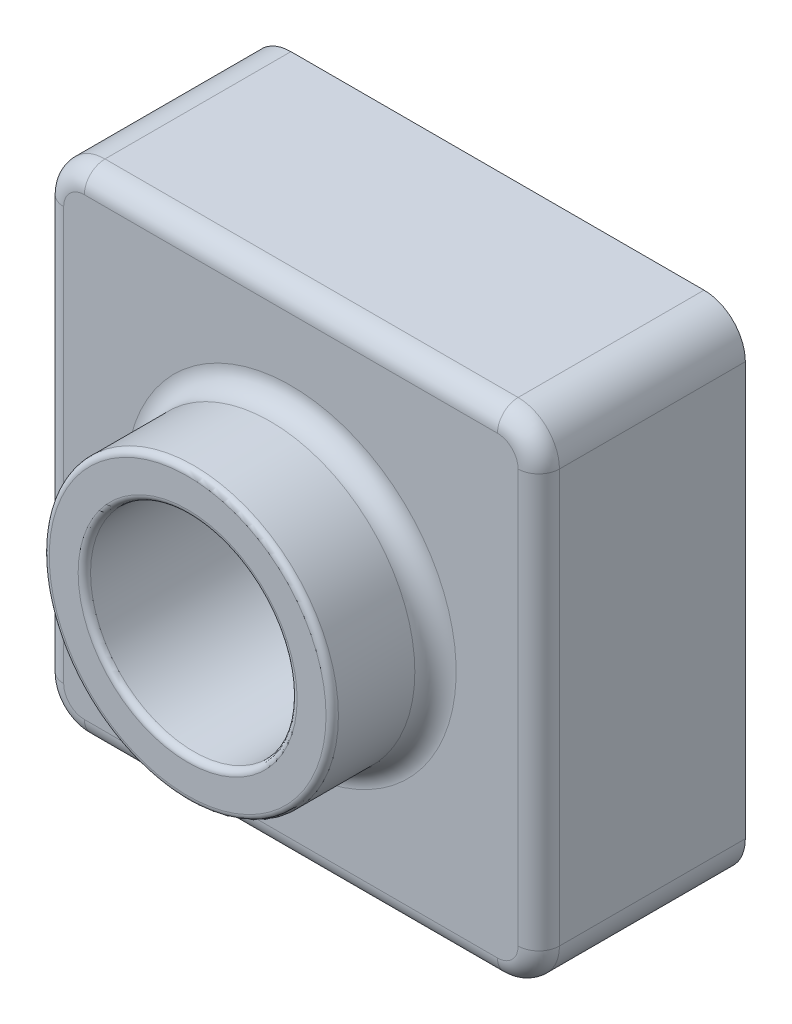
from build123d import *

# Parameters (mm, degrees)
SKETCH2_W           = 120
SKETCH2_H           = 120
BOSS_EXTRUDE1_DEPTH = 50
SKETCH4_R           = 35
BOSS_EXTRUDE2_DEPTH = 25
SKETCH6_R           = 25
CUT_EXTRUDE1_DEPTH  = 186.539753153
FILLET1_R           = 10
FILLET2_R           = 1.5
FILLET3_R           = 5
SHELL1_T            = -2


with BuildPart() as part:
    # Sketch2 → Boss-Extrude1 (new body)
    with BuildSketch(Plane.XY):
        with Locations((60, 60)):
            Rectangle(SKETCH2_W, SKETCH2_H)
    extrude(amount=BOSS_EXTRUDE1_DEPTH)

    # Sketch4 → Boss-Extrude2 (add)
    with BuildSketch(Plane.XY.offset(50)):
        with Locations(Location((60, 60, 0), (0, 0, 180))):
            Circle(SKETCH4_R)
    extrude(amount=BOSS_EXTRUDE2_DEPTH)

    # Sketch6 → Cut-Extrude1 (cut, through all)
    with BuildSketch(Plane.XY.offset(75)):
        with Locations((60, 60)):
            Circle(SKETCH6_R)
    extrude(amount=-CUT_EXTRUDE1_DEPTH, mode=Mode.SUBTRACT)

    # Fillet1
    fillet1_edges = [part.edges().sort_by_distance(p)[0] for p in [
        (0, 120, 25),
        (120, 120, 25),
        (120, 0, 25),
        (0, 0, 25),
    ]]
    fillet(fillet1_edges, radius=FILLET1_R)

    # Fillet2
    fillet2_edges = [part.edges().sort_by_distance(p)[0] for p in [
        (95, 60, 75),
        (35, 60, 75),
    ]]
    fillet(fillet2_edges, radius=FILLET2_R)

    # Fillet3
    fillet3_edges = [part.edges().sort_by_distance(p)[0] for p in [
        (95, 60, 50),
        (60, 0, 50),
        (0, 60, 50),
        (120, 60, 50),
        (60, 120, 50),
        (2.928932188, 117.071067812, 50),
        (117.071067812, 117.071067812, 50),
        (117.071067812, 2.928932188, 50),
        (2.928932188, 2.928932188, 50),
    ]]
    fillet(fillet3_edges, radius=FILLET3_R)

    # Shell1
    shell1_openings = [part.faces().sort_by_distance(p)[0] for p in [
        (60, 1.697056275, 0),
    ]]
    offset(amount=SHELL1_T, openings=shell1_openings, kind=Kind.INTERSECTION)


solid = part.part
